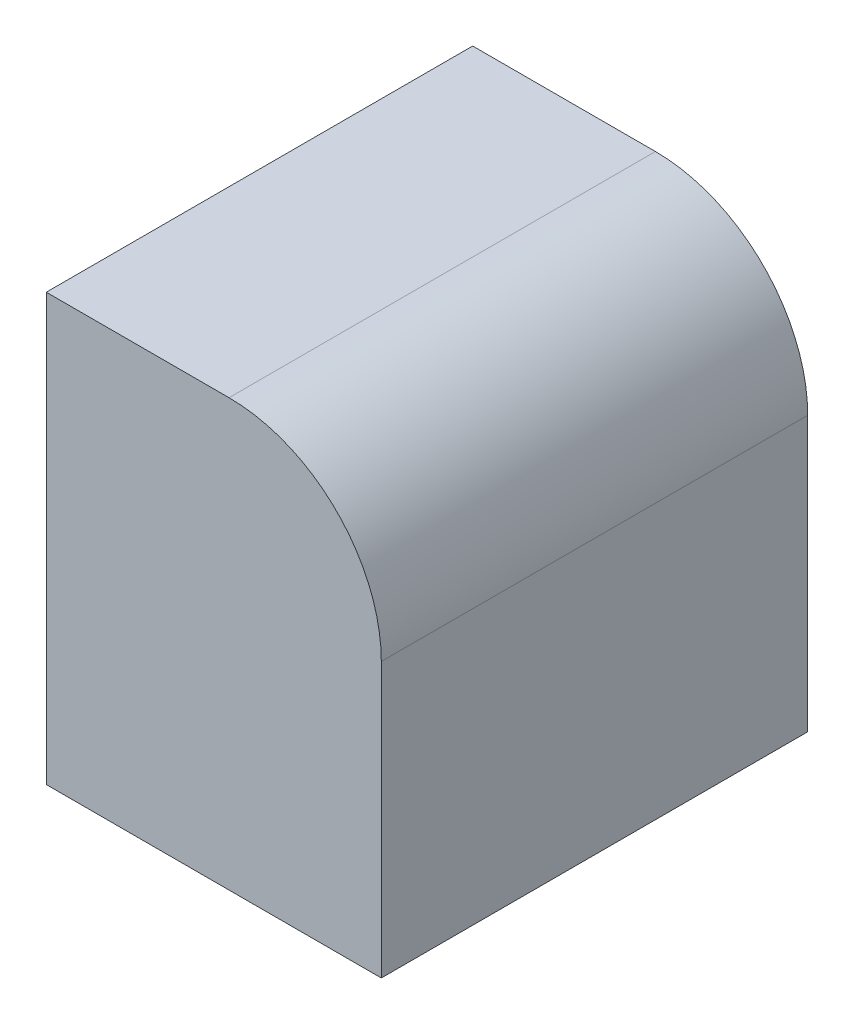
ISO-10303-21;
HEADER;
FILE_DESCRIPTION(('STEP AP214'),'2;1');
FILE_NAME('part.step','',(''),(''),'','','');
FILE_SCHEMA(('AUTOMOTIVE_DESIGN { 1 0 10303 214 1 1 1 1 }'));
ENDSEC;
DATA;
#1=APPLICATION_CONTEXT('core data for automotive mechanical design processes');
#2=APPLICATION_PROTOCOL_DEFINITION('international standard','automotive_design',2000,#1);
#3=PRODUCT_CONTEXT('',#1,'mechanical');
#4=PRODUCT('Part','Part','',(#3));
#5=PRODUCT_RELATED_PRODUCT_CATEGORY('part','',(#4));
#6=PRODUCT_DEFINITION_FORMATION('','',#4);
#7=PRODUCT_DEFINITION_CONTEXT('part definition',#1,'design');
#8=PRODUCT_DEFINITION('design','',#6,#7);
#9=PRODUCT_DEFINITION_SHAPE('','',#8);
#10=(LENGTH_UNIT() NAMED_UNIT(*) SI_UNIT(.MILLI.,.METRE.));
#11=(NAMED_UNIT(*) PLANE_ANGLE_UNIT() SI_UNIT($,.RADIAN.));
#12=(NAMED_UNIT(*) SI_UNIT($,.STERADIAN.) SOLID_ANGLE_UNIT());
#13=UNCERTAINTY_MEASURE_WITH_UNIT(LENGTH_MEASURE(1.E-05),#10,'distance_accuracy_value','');
#14=(GEOMETRIC_REPRESENTATION_CONTEXT(3) GLOBAL_UNCERTAINTY_ASSIGNED_CONTEXT((#13)) GLOBAL_UNIT_ASSIGNED_CONTEXT((#10,
#11,#12)) REPRESENTATION_CONTEXT('',''));
#15=CARTESIAN_POINT('',(0.,0.,0.));
#16=DIRECTION('',(0.,0.,1.));
#17=DIRECTION('',(1.,0.,0.));
#18=AXIS2_PLACEMENT_3D('',#15,#16,#17);
#19=CARTESIAN_POINT('',(55.,0.,0.));
#20=DIRECTION('',(0.,0.,-1.));
#21=DIRECTION('',(-1.,0.,0.));
#22=AXIS2_PLACEMENT_3D('',#19,#20,#21);
#23=PLANE('',#22);
#24=DIRECTION('',(0.,-1.,0.));
#25=VECTOR('',#24,1.);
#26=CARTESIAN_POINT('',(55.,0.,0.));
#27=LINE('',#26,#25);
#28=CARTESIAN_POINT('',(55.,45.,0.));
#29=VERTEX_POINT('',#28);
#30=CARTESIAN_POINT('',(55.,0.,0.));
#31=VERTEX_POINT('',#30);
#32=EDGE_CURVE('E76',#29,#31,#27,.T.);
#33=ORIENTED_EDGE('',*,*,#32,.F.);
#34=CARTESIAN_POINT('',(30.,45.,0.));
#35=DIRECTION('',(0.,0.,-1.));
#36=DIRECTION('',(-1.,0.,0.));
#37=AXIS2_PLACEMENT_3D('',#34,#35,#36);
#38=CIRCLE('',#37,25.);
#39=CARTESIAN_POINT('',(30.,70.,0.));
#40=VERTEX_POINT('',#39);
#41=EDGE_CURVE('E54',#29,#40,#38,.F.);
#42=ORIENTED_EDGE('',*,*,#41,.T.);
#43=DIRECTION('',(-1.,0.,0.));
#44=VECTOR('',#43,1.);
#45=CARTESIAN_POINT('',(55.,70.,0.));
#46=LINE('',#45,#44);
#47=CARTESIAN_POINT('',(0.,70.,0.));
#48=VERTEX_POINT('',#47);
#49=EDGE_CURVE('E106',#40,#48,#46,.T.);
#50=ORIENTED_EDGE('',*,*,#49,.T.);
#51=DIRECTION('',(0.,-1.,0.));
#52=VECTOR('',#51,1.);
#53=CARTESIAN_POINT('',(0.,0.,0.));
#54=LINE('',#53,#52);
#55=CARTESIAN_POINT('',(0.,0.,0.));
#56=VERTEX_POINT('',#55);
#57=EDGE_CURVE('E98',#48,#56,#54,.T.);
#58=ORIENTED_EDGE('',*,*,#57,.T.);
#59=DIRECTION('',(-1.,0.,0.));
#60=VECTOR('',#59,1.);
#61=CARTESIAN_POINT('',(55.,0.,0.));
#62=LINE('',#61,#60);
#63=EDGE_CURVE('E90',#31,#56,#62,.T.);
#64=ORIENTED_EDGE('',*,*,#63,.F.);
#65=EDGE_LOOP('',(#33,#42,#50,#58,#64));
#66=FACE_BOUND('',#65,.T.);
#67=ADVANCED_FACE('F32',(#66),#23,.F.);
#68=CARTESIAN_POINT('',(55.,0.,0.));
#69=DIRECTION('',(0.,1.,0.));
#70=DIRECTION('',(0.,0.,1.));
#71=AXIS2_PLACEMENT_3D('',#68,#69,#70);
#72=PLANE('',#71);
#73=DIRECTION('',(0.,0.,-1.));
#74=VECTOR('',#73,1.);
#75=CARTESIAN_POINT('',(0.,0.,0.));
#76=LINE('',#75,#74);
#77=CARTESIAN_POINT('',(0.,0.,-70.));
#78=VERTEX_POINT('',#77);
#79=EDGE_CURVE('E113',#56,#78,#76,.T.);
#80=ORIENTED_EDGE('',*,*,#79,.T.);
#81=DIRECTION('',(-1.,0.,0.));
#82=VECTOR('',#81,1.);
#83=CARTESIAN_POINT('',(55.,0.,-70.));
#84=LINE('',#83,#82);
#85=CARTESIAN_POINT('',(55.,0.,-70.));
#86=VERTEX_POINT('',#85);
#87=EDGE_CURVE('E93',#86,#78,#84,.T.);
#88=ORIENTED_EDGE('',*,*,#87,.F.);
#89=DIRECTION('',(0.,0.,-1.));
#90=VECTOR('',#89,1.);
#91=CARTESIAN_POINT('',(55.,0.,0.));
#92=LINE('',#91,#90);
#93=EDGE_CURVE('E80',#31,#86,#92,.T.);
#94=ORIENTED_EDGE('',*,*,#93,.F.);
#95=ORIENTED_EDGE('',*,*,#63,.T.);
#96=EDGE_LOOP('',(#80,#88,#94,#95));
#97=FACE_BOUND('',#96,.T.);
#98=ADVANCED_FACE('F89',(#97),#72,.F.);
#99=CARTESIAN_POINT('',(55.,0.,-70.));
#100=DIRECTION('',(0.,0.,1.));
#101=DIRECTION('',(1.,0.,0.));
#102=AXIS2_PLACEMENT_3D('',#99,#100,#101);
#103=PLANE('',#102);
#104=DIRECTION('',(-1.,0.,0.));
#105=VECTOR('',#104,1.);
#106=CARTESIAN_POINT('',(55.,70.,-70.));
#107=LINE('',#106,#105);
#108=CARTESIAN_POINT('',(30.,70.,-70.));
#109=VERTEX_POINT('',#108);
#110=CARTESIAN_POINT('',(0.,70.,-70.));
#111=VERTEX_POINT('',#110);
#112=EDGE_CURVE('E101',#109,#111,#107,.T.);
#113=ORIENTED_EDGE('',*,*,#112,.F.);
#114=CARTESIAN_POINT('',(30.,45.,-70.));
#115=DIRECTION('',(0.,0.,1.));
#116=DIRECTION('',(1.,0.,0.));
#117=AXIS2_PLACEMENT_3D('',#114,#115,#116);
#118=CIRCLE('',#117,25.);
#119=CARTESIAN_POINT('',(55.,45.,-70.));
#120=VERTEX_POINT('',#119);
#121=EDGE_CURVE('E11',#109,#120,#118,.F.);
#122=ORIENTED_EDGE('',*,*,#121,.T.);
#123=DIRECTION('',(0.,1.,0.));
#124=VECTOR('',#123,1.);
#125=CARTESIAN_POINT('',(55.,0.,-70.));
#126=LINE('',#125,#124);
#127=EDGE_CURVE('E95',#86,#120,#126,.T.);
#128=ORIENTED_EDGE('',*,*,#127,.F.);
#129=ORIENTED_EDGE('',*,*,#87,.T.);
#130=DIRECTION('',(0.,1.,0.));
#131=VECTOR('',#130,1.);
#132=CARTESIAN_POINT('',(0.,0.,-70.));
#133=LINE('',#132,#131);
#134=EDGE_CURVE('E110',#78,#111,#133,.T.);
#135=ORIENTED_EDGE('',*,*,#134,.T.);
#136=EDGE_LOOP('',(#113,#122,#128,#129,#135));
#137=FACE_BOUND('',#136,.T.);
#138=ADVANCED_FACE('F119',(#137),#103,.F.);
#139=CARTESIAN_POINT('',(55.,70.,0.));
#140=DIRECTION('',(0.,-1.,0.));
#141=DIRECTION('',(0.,0.,-1.));
#142=AXIS2_PLACEMENT_3D('',#139,#140,#141);
#143=PLANE('',#142);
#144=ORIENTED_EDGE('',*,*,#49,.F.);
#145=DIRECTION('',(0.,0.,1.));
#146=VECTOR('',#145,1.);
#147=CARTESIAN_POINT('',(30.,70.,0.));
#148=LINE('',#147,#146);
#149=EDGE_CURVE('E40',#40,#109,#148,.F.);
#150=ORIENTED_EDGE('',*,*,#149,.T.);
#151=ORIENTED_EDGE('',*,*,#112,.T.);
#152=DIRECTION('',(0.,0.,1.));
#153=VECTOR('',#152,1.);
#154=CARTESIAN_POINT('',(0.,70.,0.));
#155=LINE('',#154,#153);
#156=EDGE_CURVE('E85',#111,#48,#155,.T.);
#157=ORIENTED_EDGE('',*,*,#156,.T.);
#158=EDGE_LOOP('',(#144,#150,#151,#157));
#159=FACE_BOUND('',#158,.T.);
#160=ADVANCED_FACE('F122',(#159),#143,.F.);
#161=CARTESIAN_POINT('',(55.,0.,0.));
#162=DIRECTION('',(-1.,0.,0.));
#163=DIRECTION('',(0.,0.,1.));
#164=AXIS2_PLACEMENT_3D('',#161,#162,#163);
#165=PLANE('',#164);
#166=ORIENTED_EDGE('',*,*,#127,.T.);
#167=DIRECTION('',(0.,0.,1.));
#168=VECTOR('',#167,1.);
#169=CARTESIAN_POINT('',(55.,45.,0.));
#170=LINE('',#169,#168);
#171=EDGE_CURVE('E83',#120,#29,#170,.T.);
#172=ORIENTED_EDGE('',*,*,#171,.T.);
#173=ORIENTED_EDGE('',*,*,#32,.T.);
#174=ORIENTED_EDGE('',*,*,#93,.T.);
#175=EDGE_LOOP('',(#166,#172,#173,#174));
#176=FACE_BOUND('',#175,.T.);
#177=ADVANCED_FACE('F79',(#176),#165,.F.);
#178=CARTESIAN_POINT('',(0.,0.,0.));
#179=DIRECTION('',(-1.,0.,0.));
#180=DIRECTION('',(0.,0.,1.));
#181=AXIS2_PLACEMENT_3D('',#178,#179,#180);
#182=PLANE('',#181);
#183=ORIENTED_EDGE('',*,*,#57,.F.);
#184=ORIENTED_EDGE('',*,*,#156,.F.);
#185=ORIENTED_EDGE('',*,*,#134,.F.);
#186=ORIENTED_EDGE('',*,*,#79,.F.);
#187=EDGE_LOOP('',(#183,#184,#185,#186));
#188=FACE_BOUND('',#187,.T.);
#189=ADVANCED_FACE('F124',(#188),#182,.T.);
#190=CARTESIAN_POINT('',(30.,45.,0.));
#191=DIRECTION('',(0.,0.,1.));
#192=DIRECTION('',(1.,0.,0.));
#193=AXIS2_PLACEMENT_3D('',#190,#191,#192);
#194=CYLINDRICAL_SURFACE('',#193,25.);
#195=ORIENTED_EDGE('',*,*,#121,.F.);
#196=ORIENTED_EDGE('',*,*,#149,.F.);
#197=ORIENTED_EDGE('',*,*,#41,.F.);
#198=ORIENTED_EDGE('',*,*,#171,.F.);
#199=EDGE_LOOP('',(#195,#196,#197,#198));
#200=FACE_BOUND('',#199,.T.);
#201=ADVANCED_FACE('F34',(#200),#194,.T.);
#202=CLOSED_SHELL('',(#67,#98,#138,#160,#177,#189,#201));
#203=MANIFOLD_SOLID_BREP('B2',#202);
#204=ADVANCED_BREP_SHAPE_REPRESENTATION('',(#18,#203),#14);
#205=SHAPE_DEFINITION_REPRESENTATION(#9,#204);
ENDSEC;
END-ISO-10303-21;
